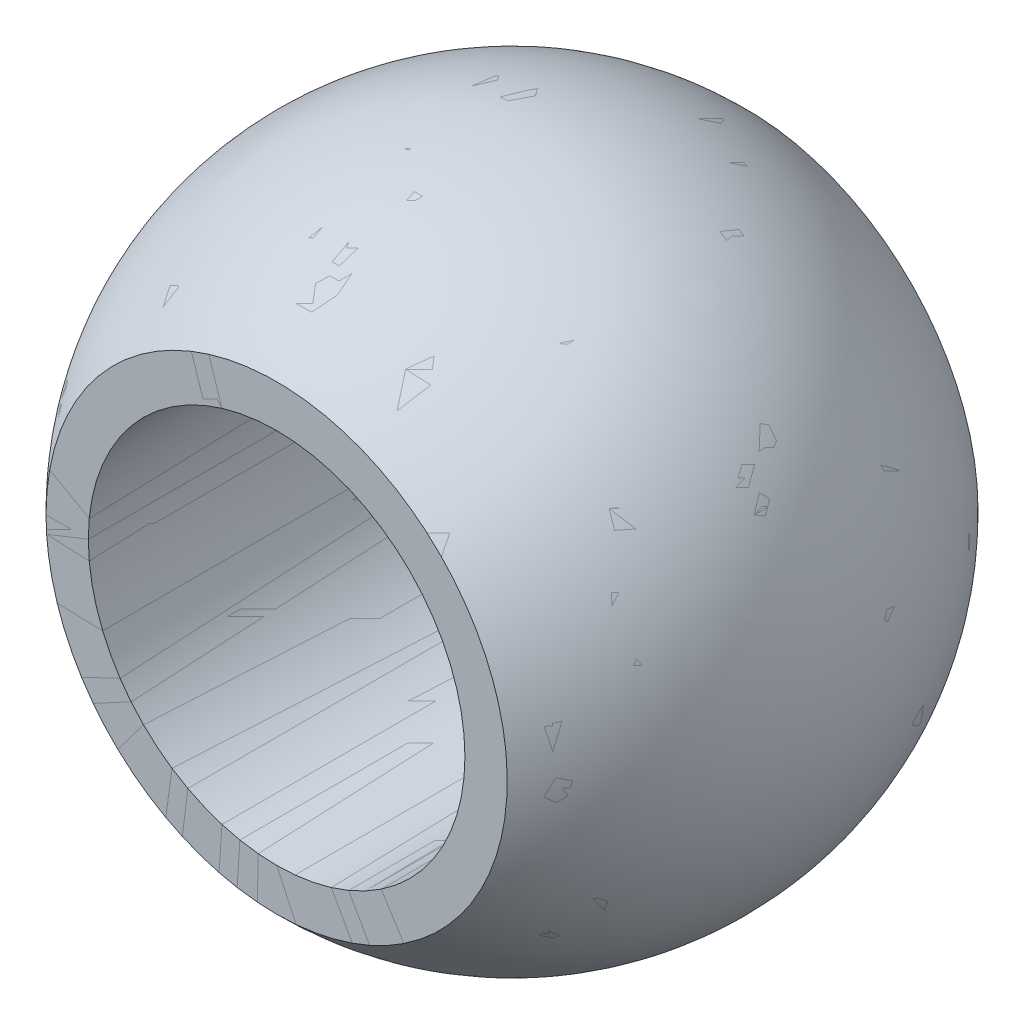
ISO-10303-21;
HEADER;
FILE_DESCRIPTION(('STEP AP214'),'2;1');
FILE_NAME('part.step','',(''),(''),'','','');
FILE_SCHEMA(('AUTOMOTIVE_DESIGN { 1 0 10303 214 1 1 1 1 }'));
ENDSEC;
DATA;
#1=APPLICATION_CONTEXT('core data for automotive mechanical design processes');
#2=APPLICATION_PROTOCOL_DEFINITION('international standard','automotive_design',2000,#1);
#3=PRODUCT_CONTEXT('',#1,'mechanical');
#4=PRODUCT('Part','Part','',(#3));
#5=PRODUCT_RELATED_PRODUCT_CATEGORY('part','',(#4));
#6=PRODUCT_DEFINITION_FORMATION('','',#4);
#7=PRODUCT_DEFINITION_CONTEXT('part definition',#1,'design');
#8=PRODUCT_DEFINITION('design','',#6,#7);
#9=PRODUCT_DEFINITION_SHAPE('','',#8);
#10=(LENGTH_UNIT() NAMED_UNIT(*) SI_UNIT(.MILLI.,.METRE.));
#11=(NAMED_UNIT(*) PLANE_ANGLE_UNIT() SI_UNIT($,.RADIAN.));
#12=(NAMED_UNIT(*) SI_UNIT($,.STERADIAN.) SOLID_ANGLE_UNIT());
#13=UNCERTAINTY_MEASURE_WITH_UNIT(LENGTH_MEASURE(1.E-05),#10,'distance_accuracy_value','');
#14=(GEOMETRIC_REPRESENTATION_CONTEXT(3) GLOBAL_UNCERTAINTY_ASSIGNED_CONTEXT((#13)) GLOBAL_UNIT_ASSIGNED_CONTEXT((#10,
#11,#12)) REPRESENTATION_CONTEXT('',''));
#15=CARTESIAN_POINT('',(0.,0.,0.));
#16=DIRECTION('',(0.,0.,1.));
#17=DIRECTION('',(1.,0.,0.));
#18=AXIS2_PLACEMENT_3D('',#15,#16,#17);
#19=CARTESIAN_POINT('',(-9.7979589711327,-9.7979589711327,-10.));
#20=DIRECTION('',(0.,0.,1.));
#21=DIRECTION('',(1.,0.,0.));
#22=AXIS2_PLACEMENT_3D('',#19,#20,#21);
#23=PLANE('',#22);
#24=CARTESIAN_POINT('',(0.,0.,-10.));
#25=DIRECTION('',(0.,0.,1.));
#26=DIRECTION('',(0.,-1.,0.));
#27=AXIS2_PLACEMENT_3D('',#24,#25,#26);
#28=CIRCLE('',#27,8.);
#29=CARTESIAN_POINT('',(0.,-8.,-10.));
#30=VERTEX_POINT('',#29);
#31=EDGE_CURVE('P0_E391',#30,#30,#28,.F.);
#32=ORIENTED_EDGE('',*,*,#31,.F.);
#33=EDGE_LOOP('',(#32));
#34=FACE_BOUND('',#33,.T.);
#35=CARTESIAN_POINT('',(9.79795897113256,-1.82145964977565E-13,-10.));
#36=CARTESIAN_POINT('',(9.7979598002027,0.250752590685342,-10.));
#37=CARTESIAN_POINT('',(9.78832968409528,0.501492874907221,-10.));
#38=CARTESIAN_POINT('',(9.74808607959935,1.02461079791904,-9.99999999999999));
#39=CARTESIAN_POINT('',(9.71561679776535,1.29684806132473,-10.));
#40=CARTESIAN_POINT('',(9.62798676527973,1.83763773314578,-10.));
#41=CARTESIAN_POINT('',(9.57282601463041,2.10619014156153,-9.99999999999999));
#42=CARTESIAN_POINT('',(9.44020112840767,2.63773216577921,-10.));
#43=CARTESIAN_POINT('',(9.36273699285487,2.90072178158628,-10.));
#44=CARTESIAN_POINT('',(9.18604983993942,3.41928668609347,-10.));
#45=CARTESIAN_POINT('',(9.08682682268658,3.67486197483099,-10.));
#46=CARTESIAN_POINT('',(8.86731947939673,4.17680221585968,-10.));
#47=CARTESIAN_POINT('',(8.7470351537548,4.42316716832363,-10.));
#48=CARTESIAN_POINT('',(8.48625079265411,4.90495458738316,-10.));
#49=CARTESIAN_POINT('',(8.34575075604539,5.14037705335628,-10.));
#50=CARTESIAN_POINT('',(8.04552271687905,5.59862448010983,-9.99999999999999));
#51=CARTESIAN_POINT('',(7.88579471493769,5.82144944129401,-9.99999999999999));
#52=CARTESIAN_POINT('',(7.54823364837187,6.25293536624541,-10.));
#53=CARTESIAN_POINT('',(7.37040058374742,6.46159633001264,-10.));
#54=CARTESIAN_POINT('',(6.99787957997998,6.86328735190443,-10.));
#55=CARTESIAN_POINT('',(6.80319164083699,7.05631741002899,-9.99999999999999));
#56=CARTESIAN_POINT('',(6.39832956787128,7.42538959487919,-9.99999999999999));
#57=CARTESIAN_POINT('',(6.18815543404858,7.60143172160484,-10.));
#58=CARTESIAN_POINT('',(5.75379852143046,7.93529044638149,-10.));
#59=CARTESIAN_POINT('',(5.52961574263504,8.0931070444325,-10.));
#60=CARTESIAN_POINT('',(5.06881757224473,8.38940524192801,-9.99999999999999));
#61=CARTESIAN_POINT('',(4.83220218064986,8.52788684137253,-10.));
#62=CARTESIAN_POINT('',(4.34820221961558,8.78454149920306,-10.));
#63=CARTESIAN_POINT('',(4.10081765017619,8.90271455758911,-9.99999999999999));
#64=CARTESIAN_POINT('',(3.59701847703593,9.11792136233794,-10.));
#65=CARTESIAN_POINT('',(3.34060387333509,9.21495510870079,-10.));
#66=CARTESIAN_POINT('',(2.82054725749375,9.38720113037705,-10.));
#67=CARTESIAN_POINT('',(2.55690524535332,9.46241340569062,-10.));
#68=CARTESIAN_POINT('',(2.02424724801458,9.59048773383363,-10.));
#69=CARTESIAN_POINT('',(1.75523126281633,9.64334978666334,-10.));
#70=CARTESIAN_POINT('',(1.21371653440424,9.72635204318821,-9.99999999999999));
#71=CARTESIAN_POINT('',(0.941217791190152,9.75649224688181,-10.));
#72=CARTESIAN_POINT('',(0.394653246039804,9.7938389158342,-10.));
#73=CARTESIAN_POINT('',(0.120587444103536,9.80104538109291,-10.));
#74=CARTESIAN_POINT('',(-0.427184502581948,9.79247391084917,-10.));
#75=CARTESIAN_POINT('',(-0.700890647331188,9.7766959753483,-9.99999999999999));
#76=CARTESIAN_POINT('',(-1.24601909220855,9.72226662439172,-10.));
#77=CARTESIAN_POINT('',(-1.51744139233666,9.68361520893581,-10.));
#78=CARTESIAN_POINT('',(-2.05609401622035,9.58371062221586,-10.));
#79=CARTESIAN_POINT('',(-2.32332433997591,9.52245745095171,-10.));
#80=CARTESIAN_POINT('',(-2.85171434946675,9.37777996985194,-9.99999999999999));
#81=CARTESIAN_POINT('',(-3.11287403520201,9.29435566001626,-9.99999999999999));
#82=CARTESIAN_POINT('',(-3.62728678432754,9.10592238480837,-10.));
#83=CARTESIAN_POINT('',(-3.88053984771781,9.00091341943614,-10.));
#84=CARTESIAN_POINT('',(-4.37735895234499,8.77004905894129,-10.));
#85=CARTESIAN_POINT('',(-4.62092499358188,8.64419366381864,-10.));
#86=CARTESIAN_POINT('',(-5.09665775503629,8.37252122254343,-10.));
#87=CARTESIAN_POINT('',(-5.32882447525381,8.22670417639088,-10.));
#88=CARTESIAN_POINT('',(-5.78012643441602,7.91613354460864,-10.));
#89=CARTESIAN_POINT('',(-5.9992616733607,7.75137995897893,-10.));
#90=CARTESIAN_POINT('',(-6.42296012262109,7.4040944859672,-10.));
#91=CARTESIAN_POINT('',(-6.6275233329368,7.22156259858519,-10.));
#92=CARTESIAN_POINT('',(-7.02063962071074,6.84000374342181,-10.));
#93=CARTESIAN_POINT('',(-7.20919269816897,6.64097677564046,-10.));
#94=CARTESIAN_POINT('',(-7.5689631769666,6.22782693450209,-10.));
#95=CARTESIAN_POINT('',(-7.74018057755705,6.01370406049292,-10.));
#96=CARTESIAN_POINT('',(-8.06407600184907,5.57186774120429,-9.99999999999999));
#97=CARTESIAN_POINT('',(-8.21675402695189,5.34415429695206,-9.99999999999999));
#98=CARTESIAN_POINT('',(-8.5024973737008,4.87673767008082,-10.));
#99=CARTESIAN_POINT('',(-8.63556269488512,4.63703448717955,-10.));
#100=CARTESIAN_POINT('',(-8.88114516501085,4.14732352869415,-10.));
#101=CARTESIAN_POINT('',(-8.99366231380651,3.89731575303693,-10.));
#102=CARTESIAN_POINT('',(-9.19735742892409,3.38875319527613,-9.99999999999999));
#103=CARTESIAN_POINT('',(-9.2885353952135,3.13019841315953,-10.));
#104=CARTESIAN_POINT('',(-9.4489111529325,2.60635951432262,-10.));
#105=CARTESIAN_POINT('',(-9.51810894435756,2.34107539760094,-10.));
#106=CARTESIAN_POINT('',(-9.63403788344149,1.80564280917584,-9.99999999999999));
#107=CARTESIAN_POINT('',(-9.68076903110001,1.53549433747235,-9.99999999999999));
#108=CARTESIAN_POINT('',(-9.75143615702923,0.992232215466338,-9.99999999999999));
#109=CARTESIAN_POINT('',(-9.77537213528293,0.719118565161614,-10.));
#110=CARTESIAN_POINT('',(-9.80028064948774,0.17184610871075,-10.));
#111=CARTESIAN_POINT('',(-9.8012531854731,-0.10231269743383,-10.));
#112=CARTESIAN_POINT('',(-9.78022797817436,-0.649748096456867,-10.));
#113=CARTESIAN_POINT('',(-9.75823023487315,-0.923024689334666,-10.));
#114=CARTESIAN_POINT('',(-9.69141911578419,-1.46677449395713,-10.));
#115=CARTESIAN_POINT('',(-9.64660573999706,-1.73724770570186,-10.));
#116=CARTESIAN_POINT('',(-9.53447839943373,-2.27348928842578,-10.));
#117=CARTESIAN_POINT('',(-9.46716443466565,-2.53925765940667,-10.));
#118=CARTESIAN_POINT('',(-9.31050914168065,-3.06422117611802,-10.));
#119=CARTESIAN_POINT('',(-9.22116781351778,-3.32341632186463,-10.));
#120=CARTESIAN_POINT('',(-9.02108587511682,-3.83341121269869,-10.));
#121=CARTESIAN_POINT('',(-8.91034526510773,-4.084210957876,-10.));
#122=CARTESIAN_POINT('',(-8.66824328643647,-4.57565188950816,-10.));
#123=CARTESIAN_POINT('',(-8.53688191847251,-4.81629307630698,-9.99999999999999));
#124=CARTESIAN_POINT('',(-8.25446189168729,-5.28572518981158,-9.99999999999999));
#125=CARTESIAN_POINT('',(-8.10340323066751,-5.51451611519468,-9.99999999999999));
#126=CARTESIAN_POINT('',(-7.78265060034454,-5.95863923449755,-10.));
#127=CARTESIAN_POINT('',(-7.61295663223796,-6.17397142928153,-10.));
#128=CARTESIAN_POINT('',(-7.2561263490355,-6.58966329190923,-10.));
#129=CARTESIAN_POINT('',(-7.06899003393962,-6.79002295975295,-10.));
#130=CARTESIAN_POINT('',(-6.67859064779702,-7.17436121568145,-9.99999999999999));
#131=CARTESIAN_POINT('',(-6.47532757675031,-7.35833980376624,-9.99999999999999));
#132=CARTESIAN_POINT('',(-6.05410364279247,-7.70862250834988,-9.99999999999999));
#133=CARTESIAN_POINT('',(-5.83614277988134,-7.87492662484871,-10.));
#134=CARTESIAN_POINT('',(-5.38705555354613,-8.18869124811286,-10.));
#135=CARTESIAN_POINT('',(-5.15592919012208,-8.33615175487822,-9.99999999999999));
#136=CARTESIAN_POINT('',(-4.68213580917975,-8.61119249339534,-10.));
#137=CARTESIAN_POINT('',(-4.43946879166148,-8.73877272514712,-10.));
#138=CARTESIAN_POINT('',(-3.94430008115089,-8.97315600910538,-10.));
#139=CARTESIAN_POINT('',(-3.69179838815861,-9.07995906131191,-10.));
#140=CARTESIAN_POINT('',(-3.17873544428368,-9.27203714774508,-10.));
#141=CARTESIAN_POINT('',(-2.91817419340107,-9.35731218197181,-10.));
#142=CARTESIAN_POINT('',(-2.3908239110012,-9.50573473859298,-10.));
#143=CARTESIAN_POINT('',(-2.12403487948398,-9.56888226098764,-10.));
#144=CARTESIAN_POINT('',(-1.58610459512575,-9.67260585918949,-10.));
#145=CARTESIAN_POINT('',(-1.31496334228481,-9.71318193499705,-9.99999999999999));
#146=CARTESIAN_POINT('',(-0.770234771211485,-9.7714773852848,-9.99999999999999));
#147=CARTESIAN_POINT('',(-0.49664745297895,-9.78919675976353,-9.99999999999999));
#148=CARTESIAN_POINT('',(0.0510498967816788,-9.80165423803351,-10.));
#149=CARTESIAN_POINT('',(0.325159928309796,-9.79639234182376,-10.));
#150=CARTESIAN_POINT('',(0.871975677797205,-9.76292427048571,-10.));
#151=CARTESIAN_POINT('',(1.14468139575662,-9.73471809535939,-10.));
#152=CARTESIAN_POINT('',(1.6867713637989,-9.65555975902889,-10.));
#153=CARTESIAN_POINT('',(1.95615561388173,-9.60460759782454,-9.99999999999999));
#154=CARTESIAN_POINT('',(2.4897088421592,-9.48031548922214,-9.99999999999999));
#155=CARTESIAN_POINT('',(2.7538778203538,-9.40697554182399,-9.99999999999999));
#156=CARTESIAN_POINT('',(3.27514336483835,-9.23842344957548,-9.99999999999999));
#157=CARTESIAN_POINT('',(3.53223993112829,-9.14321130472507,-9.99999999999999));
#158=CARTESIAN_POINT('',(4.03755323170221,-8.93158417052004,-10.));
#159=CARTESIAN_POINT('',(4.28576996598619,-8.81516918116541,-10.));
#160=CARTESIAN_POINT('',(4.77157860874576,-8.56195476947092,-10.));
#161=CARTESIAN_POINT('',(5.00917051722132,-8.42515534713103,-10.));
#162=CARTESIAN_POINT('',(5.47205920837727,-8.13213378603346,-10.));
#163=CARTESIAN_POINT('',(5.69735599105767,-7.97591164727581,-9.99999999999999));
#164=CARTESIAN_POINT('',(6.13407056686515,-7.64514291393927,-10.));
#165=CARTESIAN_POINT('',(6.34548835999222,-7.47059631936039,-10.));
#166=CARTESIAN_POINT('',(6.75295866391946,-7.10440575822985,-10.));
#167=CARTESIAN_POINT('',(6.94901117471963,-6.91276179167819,-10.));
#168=CARTESIAN_POINT('',(7.32437265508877,-6.51372375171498,-10.));
#169=CARTESIAN_POINT('',(7.50368162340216,-6.30632967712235,-10.));
#170=CARTESIAN_POINT('',(7.84429541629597,-5.87724946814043,-10.));
#171=CARTESIAN_POINT('',(8.00560024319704,-5.65556333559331,-10.));
#172=CARTESIAN_POINT('',(8.30907179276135,-5.19945745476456,-10.));
#173=CARTESIAN_POINT('',(8.45123851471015,-4.96503770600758,-10.));
#174=CARTESIAN_POINT('',(8.71543440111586,-4.48511261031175,-10.));
#175=CARTESIAN_POINT('',(8.83746356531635,-4.23960726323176,-10.));
#176=CARTESIAN_POINT('',(9.06052644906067,-3.73923685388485,-10.));
#177=CARTESIAN_POINT('',(9.16156016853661,-3.48437179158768,-10.));
#178=CARTESIAN_POINT('',(9.34192190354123,-2.96707387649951,-10.));
#179=CARTESIAN_POINT('',(9.42124991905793,-2.70464102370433,-9.99999999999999));
#180=CARTESIAN_POINT('',(9.55764248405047,-2.17405174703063,-9.99999999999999));
#181=CARTESIAN_POINT('',(9.6147070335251,-1.9058953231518,-10.));
#182=CARTESIAN_POINT('',(9.70617178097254,-1.3657467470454,-10.));
#183=CARTESIAN_POINT('',(9.74057197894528,-1.09375459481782,-10.));
#184=CARTESIAN_POINT('',(9.78646512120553,-0.547836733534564,-10.));
#185=CARTESIAN_POINT('',(9.79795806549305,-0.273911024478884,-10.));
#186=CARTESIAN_POINT('',(9.79795897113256,-1.82145964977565E-13,-10.));
#187=B_SPLINE_CURVE_WITH_KNOTS('',3,(#35,#36,#37,#38,#39,#40,#41,#42,#43,#44,#45,#46,#47,#48,
#49,#50,#51,#52,#53,#54,#55,#56,#57,#58,#59,#60,#61,#62,#63,#64,#65,#66,#67,#68,#69,#70,#71,#72,
#73,#74,#75,#76,#77,#78,#79,#80,#81,#82,#83,#84,#85,#86,#87,#88,#89,#90,#91,#92,#93,#94,#95,#96,
#97,#98,#99,#100,#101,#102,#103,#104,#105,#106,#107,#108,#109,#110,#111,#112,#113,#114,#115,
#116,#117,#118,#119,#120,#121,#122,#123,#124,#125,#126,#127,#128,#129,#130,#131,#132,#133,#134,
#135,#136,#137,#138,#139,#140,#141,#142,#143,#144,#145,#146,#147,#148,#149,#150,#151,#152,#153,
#154,#155,#156,#157,#158,#159,#160,#161,#162,#163,#164,#165,#166,#167,#168,#169,#170,#171,#172,
#173,#174,#175,#176,#177,#178,#179,#180,#181,#182,#183,#184,#185,#186),.UNSPECIFIED.,.T.,.F.,(4,
2,2,2,2,2,2,2,2,2,2,2,2,2,2,2,2,2,2,2,2,2,2,2,2,2,2,2,2,2,2,2,2,2,2,2,2,2,2,2,2,2,2,2,2,2,2,2,2,
2,2,2,2,2,2,2,2,2,2,2,2,2,2,2,2,2,2,2,2,2,2,2,2,2,2,4),(0.,0.752060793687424,1.57357869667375,
2.39509659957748,3.21661450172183,4.03813239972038,4.85965028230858,5.68116821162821,
6.50268611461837,7.32420401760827,8.14572192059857,8.96723982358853,9.7887577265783,
10.6102756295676,11.4317935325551,12.2533114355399,13.074829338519,13.8963472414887,
14.7178651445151,15.5393830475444,16.3609009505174,17.1824188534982,18.0039367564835,
18.8254546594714,19.6469725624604,20.4684904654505,21.29000836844,22.1115262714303,
22.9330441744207,23.7545620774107,24.5760800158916,25.3975978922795,26.2191157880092,
27.0406336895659,27.8621515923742,28.6836694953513,29.5051873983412,30.3267053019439,
31.1482232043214,31.969741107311,32.7912590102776,33.6127769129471,34.4342948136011,
35.2558127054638,36.0773305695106,36.8988485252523,37.7203664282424,38.5418843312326,
39.3634022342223,40.1849201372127,41.006438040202,41.8279559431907,42.649473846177,
43.4709917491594,44.2925096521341,45.1140275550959,45.9355454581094,46.7570633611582,
47.5785812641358,48.4000991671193,49.2216170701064,50.0431349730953,50.8646528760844,
51.6861707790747,52.5076886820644,53.3292065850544,54.1507244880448,54.9722424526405,
55.7937603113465,56.6152782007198,57.4367961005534,58.2583140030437,59.0798319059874,
59.9013498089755,60.722867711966,61.5443856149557),.UNSPECIFIED.);
#188=CARTESIAN_POINT('',(9.79795897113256,-1.82145964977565E-13,-10.));
#189=VERTEX_POINT('',#188);
#190=EDGE_CURVE('P0_E353',#189,#189,#187,.T.);
#191=ORIENTED_EDGE('',*,*,#190,.F.);
#192=EDGE_LOOP('',(#191));
#193=FACE_BOUND('',#192,.T.);
#194=ADVANCED_FACE('P0_F348',(#34,#193),#23,.F.);
#195=CARTESIAN_POINT('',(0.,0.,-10.));
#196=DIRECTION('',(0.,0.,1.));
#197=DIRECTION('',(0.,-1.,0.));
#198=AXIS2_PLACEMENT_3D('',#195,#196,#197);
#199=CYLINDRICAL_SURFACE('',#198,8.);
#200=ORIENTED_EDGE('',*,*,#31,.T.);
#201=EDGE_LOOP('',(#200));
#202=FACE_BOUND('',#201,.T.);
#203=CARTESIAN_POINT('',(0.,0.,10.));
#204=DIRECTION('',(0.,0.,1.));
#205=DIRECTION('',(0.,-1.,0.));
#206=AXIS2_PLACEMENT_3D('',#203,#204,#205);
#207=CIRCLE('',#206,8.);
#208=CARTESIAN_POINT('',(0.,-8.,10.));
#209=VERTEX_POINT('',#208);
#210=EDGE_CURVE('P0_E361',#209,#209,#207,.T.);
#211=ORIENTED_EDGE('',*,*,#210,.T.);
#212=EDGE_LOOP('',(#211));
#213=FACE_BOUND('',#212,.T.);
#214=ADVANCED_FACE('P0_F373',(#202,#213),#199,.F.);
#215=CARTESIAN_POINT('',(9.7979589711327,-9.7979589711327,10.));
#216=DIRECTION('',(0.,0.,-1.));
#217=DIRECTION('',(-1.,0.,0.));
#218=AXIS2_PLACEMENT_3D('',#215,#216,#217);
#219=PLANE('',#218);
#220=ORIENTED_EDGE('',*,*,#210,.F.);
#221=EDGE_LOOP('',(#220));
#222=FACE_BOUND('',#221,.T.);
#223=CARTESIAN_POINT('',(-9.79795897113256,-2.92300905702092E-13,10.));
#224=CARTESIAN_POINT('',(-9.79795980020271,0.250752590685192,10.));
#225=CARTESIAN_POINT('',(-9.78832968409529,0.501492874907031,10.));
#226=CARTESIAN_POINT('',(-9.74808607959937,1.02461079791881,10.));
#227=CARTESIAN_POINT('',(-9.71561679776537,1.2968480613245,10.));
#228=CARTESIAN_POINT('',(-9.62798676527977,1.83763773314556,10.));
#229=CARTESIAN_POINT('',(-9.57282601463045,2.10619014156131,10.));
#230=CARTESIAN_POINT('',(-9.44020112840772,2.637732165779,10.));
#231=CARTESIAN_POINT('',(-9.36273699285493,2.90072178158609,9.99999999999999));
#232=CARTESIAN_POINT('',(-9.1860498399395,3.41928668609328,10.));
#233=CARTESIAN_POINT('',(-9.08682682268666,3.67486197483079,10.));
#234=CARTESIAN_POINT('',(-8.86731947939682,4.1768022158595,10.));
#235=CARTESIAN_POINT('',(-8.74703515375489,4.42316716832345,10.));
#236=CARTESIAN_POINT('',(-8.48625079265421,4.90495458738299,9.99999999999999));
#237=CARTESIAN_POINT('',(-8.34575075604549,5.14037705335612,9.99999999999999));
#238=CARTESIAN_POINT('',(-8.04552271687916,5.59862448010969,10.));
#239=CARTESIAN_POINT('',(-7.8857947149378,5.82144944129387,10.));
#240=CARTESIAN_POINT('',(-7.54823364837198,6.25293536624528,10.));
#241=CARTESIAN_POINT('',(-7.37040058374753,6.46159633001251,10.));
#242=CARTESIAN_POINT('',(-6.9978795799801,6.86328735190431,10.));
#243=CARTESIAN_POINT('',(-6.8031916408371,7.05631741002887,10.));
#244=CARTESIAN_POINT('',(-6.3983295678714,7.42538959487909,10.));
#245=CARTESIAN_POINT('',(-6.18815543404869,7.60143172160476,10.));
#246=CARTESIAN_POINT('',(-5.75379852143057,7.93529044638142,10.));
#247=CARTESIAN_POINT('',(-5.52961574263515,8.09310704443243,10.));
#248=CARTESIAN_POINT('',(-5.06881757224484,8.38940524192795,10.));
#249=CARTESIAN_POINT('',(-4.83220218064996,8.52788684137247,10.));
#250=CARTESIAN_POINT('',(-4.34820221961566,8.78454149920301,10.));
#251=CARTESIAN_POINT('',(-4.10081765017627,8.90271455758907,10.));
#252=CARTESIAN_POINT('',(-3.597018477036,9.11792136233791,10.));
#253=CARTESIAN_POINT('',(-3.34060387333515,9.21495510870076,10.));
#254=CARTESIAN_POINT('',(-2.82054725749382,9.38720113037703,10.));
#255=CARTESIAN_POINT('',(-2.55690524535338,9.4624134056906,10.));
#256=CARTESIAN_POINT('',(-2.02424724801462,9.59048773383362,10.));
#257=CARTESIAN_POINT('',(-1.75523126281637,9.64334978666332,10.));
#258=CARTESIAN_POINT('',(-1.21371653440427,9.72635204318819,10.));
#259=CARTESIAN_POINT('',(-0.941217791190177,9.7564922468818,10.));
#260=CARTESIAN_POINT('',(-0.394653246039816,9.79383891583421,10.));
#261=CARTESIAN_POINT('',(-0.12058744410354,9.80104538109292,10.));
#262=CARTESIAN_POINT('',(0.427184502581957,9.79247391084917,9.99999999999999));
#263=CARTESIAN_POINT('',(0.700890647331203,9.7766959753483,9.99999999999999));
#264=CARTESIAN_POINT('',(1.24601909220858,9.72226662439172,9.99999999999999));
#265=CARTESIAN_POINT('',(1.51744139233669,9.6836152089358,10.));
#266=CARTESIAN_POINT('',(2.05609401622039,9.58371062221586,10.));
#267=CARTESIAN_POINT('',(2.32332433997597,9.52245745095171,10.));
#268=CARTESIAN_POINT('',(2.85171434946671,9.37777996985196,10.));
#269=CARTESIAN_POINT('',(3.11287403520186,9.2943556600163,10.));
#270=CARTESIAN_POINT('',(3.62728678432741,9.10592238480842,10.));
#271=CARTESIAN_POINT('',(3.88053984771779,9.00091341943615,10.));
#272=CARTESIAN_POINT('',(4.37735895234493,8.77004905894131,10.));
#273=CARTESIAN_POINT('',(4.62092499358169,8.64419366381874,10.));
#274=CARTESIAN_POINT('',(5.09665775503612,8.37252122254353,10.));
#275=CARTESIAN_POINT('',(5.32882447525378,8.2267041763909,10.));
#276=CARTESIAN_POINT('',(5.78012643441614,7.91613354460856,9.99999999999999));
#277=CARTESIAN_POINT('',(5.99926167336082,7.75137995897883,9.99999999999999));
#278=CARTESIAN_POINT('',(6.42296012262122,7.40409448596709,9.99999999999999));
#279=CARTESIAN_POINT('',(6.62752333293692,7.22156259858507,10.));
#280=CARTESIAN_POINT('',(7.02063962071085,6.84000374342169,10.));
#281=CARTESIAN_POINT('',(7.20919269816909,6.64097677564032,10.));
#282=CARTESIAN_POINT('',(7.56896317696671,6.22782693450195,10.));
#283=CARTESIAN_POINT('',(7.74018057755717,6.01370406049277,10.));
#284=CARTESIAN_POINT('',(8.06407600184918,5.57186774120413,10.));
#285=CARTESIAN_POINT('',(8.21675402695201,5.34415429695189,10.));
#286=CARTESIAN_POINT('',(8.5024973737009,4.87673767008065,9.99999999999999));
#287=CARTESIAN_POINT('',(8.63556269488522,4.63703448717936,9.99999999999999));
#288=CARTESIAN_POINT('',(8.88114516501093,4.14732352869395,10.));
#289=CARTESIAN_POINT('',(8.99366231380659,3.89731575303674,10.));
#290=CARTESIAN_POINT('',(9.19735742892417,3.38875319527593,10.));
#291=CARTESIAN_POINT('',(9.28853539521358,3.13019841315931,10.));
#292=CARTESIAN_POINT('',(9.44891115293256,2.6063595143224,10.));
#293=CARTESIAN_POINT('',(9.51810894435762,2.34107539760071,10.));
#294=CARTESIAN_POINT('',(9.63403788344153,1.80564280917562,10.));
#295=CARTESIAN_POINT('',(9.68076903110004,1.53549433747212,10.));
#296=CARTESIAN_POINT('',(9.75143615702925,0.992232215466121,10.));
#297=CARTESIAN_POINT('',(9.77537213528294,0.719118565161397,9.99999999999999));
#298=CARTESIAN_POINT('',(9.80028064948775,0.171846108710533,10.));
#299=CARTESIAN_POINT('',(9.8012531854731,-0.102312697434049,10.));
#300=CARTESIAN_POINT('',(9.78022797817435,-0.649748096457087,10.));
#301=CARTESIAN_POINT('',(9.75823023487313,-0.923024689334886,10.));
#302=CARTESIAN_POINT('',(9.69141911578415,-1.46677449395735,10.));
#303=CARTESIAN_POINT('',(9.64660573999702,-1.73724770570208,10.));
#304=CARTESIAN_POINT('',(9.53447839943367,-2.273489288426,10.));
#305=CARTESIAN_POINT('',(9.46716443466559,-2.53925765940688,10.));
#306=CARTESIAN_POINT('',(9.31050914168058,-3.06422117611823,9.99999999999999));
#307=CARTESIAN_POINT('',(9.2211678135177,-3.32341632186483,10.));
#308=CARTESIAN_POINT('',(9.02108587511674,-3.83341121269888,10.));
#309=CARTESIAN_POINT('',(8.91034526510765,-4.08421095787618,10.));
#310=CARTESIAN_POINT('',(8.66824328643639,-4.57565188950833,10.));
#311=CARTESIAN_POINT('',(8.53688191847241,-4.81629307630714,10.));
#312=CARTESIAN_POINT('',(8.25446189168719,-5.28572518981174,10.));
#313=CARTESIAN_POINT('',(8.1034032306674,-5.51451611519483,10.));
#314=CARTESIAN_POINT('',(7.78265060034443,-5.95863923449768,10.));
#315=CARTESIAN_POINT('',(7.61295663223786,-6.17397142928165,10.));
#316=CARTESIAN_POINT('',(7.2561263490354,-6.58966329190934,10.));
#317=CARTESIAN_POINT('',(7.06899003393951,-6.79002295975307,10.));
#318=CARTESIAN_POINT('',(6.6785906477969,-7.17436121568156,10.));
#319=CARTESIAN_POINT('',(6.47532757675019,-7.35833980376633,10.));
#320=CARTESIAN_POINT('',(6.05410364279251,-7.70862250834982,10.));
#321=CARTESIAN_POINT('',(5.83614277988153,-7.87492662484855,10.));
#322=CARTESIAN_POINT('',(5.38705555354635,-8.18869124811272,10.));
#323=CARTESIAN_POINT('',(5.15592919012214,-8.33615175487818,9.99999999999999));
#324=CARTESIAN_POINT('',(4.68213580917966,-8.61119249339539,9.99999999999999));
#325=CARTESIAN_POINT('',(4.43946879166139,-8.73877272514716,10.));
#326=CARTESIAN_POINT('',(3.94430008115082,-8.97315600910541,10.));
#327=CARTESIAN_POINT('',(3.69179838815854,-9.07995906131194,10.));
#328=CARTESIAN_POINT('',(3.17873544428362,-9.2720371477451,10.));
#329=CARTESIAN_POINT('',(2.91817419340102,-9.35731218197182,10.));
#330=CARTESIAN_POINT('',(2.39082391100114,-9.50573473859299,10.));
#331=CARTESIAN_POINT('',(2.12403487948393,-9.56888226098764,10.));
#332=CARTESIAN_POINT('',(1.58610459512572,-9.6726058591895,10.));
#333=CARTESIAN_POINT('',(1.31496334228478,-9.71318193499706,9.99999999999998));
#334=CARTESIAN_POINT('',(0.770234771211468,-9.7714773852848,9.99999999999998));
#335=CARTESIAN_POINT('',(0.49664745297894,-9.78919675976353,10.));
#336=CARTESIAN_POINT('',(-0.0510498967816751,-9.80165423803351,10.));
#337=CARTESIAN_POINT('',(-0.325159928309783,-9.79639234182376,10.));
#338=CARTESIAN_POINT('',(-0.871975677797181,-9.76292427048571,9.99999999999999));
#339=CARTESIAN_POINT('',(-1.14468139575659,-9.73471809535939,9.99999999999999));
#340=CARTESIAN_POINT('',(-1.68677136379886,-9.65555975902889,9.99999999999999));
#341=CARTESIAN_POINT('',(-1.95615561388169,-9.60460759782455,9.99999999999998));
#342=CARTESIAN_POINT('',(-2.48970884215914,-9.48031548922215,9.99999999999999));
#343=CARTESIAN_POINT('',(-2.75387782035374,-9.40697554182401,9.99999999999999));
#344=CARTESIAN_POINT('',(-3.27514336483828,-9.2384234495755,10.));
#345=CARTESIAN_POINT('',(-3.53223993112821,-9.1432113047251,10.));
#346=CARTESIAN_POINT('',(-4.03755323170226,-8.93158417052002,10.));
#347=CARTESIAN_POINT('',(-4.28576996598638,-8.81516918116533,10.));
#348=CARTESIAN_POINT('',(-4.77157860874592,-8.56195476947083,10.));
#349=CARTESIAN_POINT('',(-5.00917051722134,-8.42515534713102,9.99999999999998));
#350=CARTESIAN_POINT('',(-5.47205920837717,-8.13213378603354,9.99999999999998));
#351=CARTESIAN_POINT('',(-5.69735599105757,-7.97591164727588,10.));
#352=CARTESIAN_POINT('',(-6.13407056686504,-7.64514291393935,10.));
#353=CARTESIAN_POINT('',(-6.3454883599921,-7.47059631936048,10.));
#354=CARTESIAN_POINT('',(-6.75295866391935,-7.10440575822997,10.));
#355=CARTESIAN_POINT('',(-6.94901117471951,-6.91276179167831,10.));
#356=CARTESIAN_POINT('',(-7.32437265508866,-6.51372375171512,9.99999999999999));
#357=CARTESIAN_POINT('',(-7.50368162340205,-6.30632967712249,9.99999999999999));
#358=CARTESIAN_POINT('',(-7.84429541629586,-5.87724946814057,9.99999999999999));
#359=CARTESIAN_POINT('',(-8.00560024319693,-5.65556333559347,10.));
#360=CARTESIAN_POINT('',(-8.30907179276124,-5.19945745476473,10.));
#361=CARTESIAN_POINT('',(-8.45123851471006,-4.96503770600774,10.));
#362=CARTESIAN_POINT('',(-8.71543440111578,-4.48511261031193,9.99999999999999));
#363=CARTESIAN_POINT('',(-8.83746356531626,-4.23960726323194,9.99999999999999));
#364=CARTESIAN_POINT('',(-9.06052644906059,-3.73923685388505,10.));
#365=CARTESIAN_POINT('',(-9.16156016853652,-3.48437179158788,10.));
#366=CARTESIAN_POINT('',(-9.34192190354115,-2.96707387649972,10.));
#367=CARTESIAN_POINT('',(-9.42124991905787,-2.70464102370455,9.99999999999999));
#368=CARTESIAN_POINT('',(-9.55764248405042,-2.17405174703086,9.99999999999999));
#369=CARTESIAN_POINT('',(-9.61470703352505,-1.90589532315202,10.));
#370=CARTESIAN_POINT('',(-9.70617178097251,-1.36574674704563,10.));
#371=CARTESIAN_POINT('',(-9.74057197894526,-1.09375459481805,10.));
#372=CARTESIAN_POINT('',(-9.78646512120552,-0.547836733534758,9.99999999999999));
#373=CARTESIAN_POINT('',(-9.79795806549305,-0.273911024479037,10.));
#374=CARTESIAN_POINT('',(-9.79795897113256,-2.92300905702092E-13,10.));
#375=B_SPLINE_CURVE_WITH_KNOTS('',3,(#223,#224,#225,#226,#227,#228,#229,#230,#231,#232,#233,
#234,#235,#236,#237,#238,#239,#240,#241,#242,#243,#244,#245,#246,#247,#248,#249,#250,#251,#252,
#253,#254,#255,#256,#257,#258,#259,#260,#261,#262,#263,#264,#265,#266,#267,#268,#269,#270,#271,
#272,#273,#274,#275,#276,#277,#278,#279,#280,#281,#282,#283,#284,#285,#286,#287,#288,#289,#290,
#291,#292,#293,#294,#295,#296,#297,#298,#299,#300,#301,#302,#303,#304,#305,#306,#307,#308,#309,
#310,#311,#312,#313,#314,#315,#316,#317,#318,#319,#320,#321,#322,#323,#324,#325,#326,#327,#328,
#329,#330,#331,#332,#333,#334,#335,#336,#337,#338,#339,#340,#341,#342,#343,#344,#345,#346,#347,
#348,#349,#350,#351,#352,#353,#354,#355,#356,#357,#358,#359,#360,#361,#362,#363,#364,#365,#366,
#367,#368,#369,#370,#371,#372,#373,#374),.UNSPECIFIED.,.T.,.F.,(4,2,2,2,2,2,2,2,2,2,2,2,2,2,2,2,
2,2,2,2,2,2,2,2,2,2,2,2,2,2,2,2,2,2,2,2,2,2,2,2,2,2,2,2,2,2,2,2,2,2,2,2,2,2,2,2,2,2,2,2,2,2,2,2,
2,2,2,2,2,2,2,2,2,2,2,4),(0.,0.752060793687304,1.57357869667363,2.39509659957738,
3.21661450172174,4.03813239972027,4.85965028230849,5.68116821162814,6.50268611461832,
7.3242040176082,8.14572192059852,8.96723982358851,9.78875772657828,10.6102756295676,
11.4317935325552,12.2533114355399,13.0748293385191,13.8963472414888,14.7178651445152,
15.5393830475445,16.3609009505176,17.1824188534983,18.0039367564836,18.8254546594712,
19.6469725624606,20.4684904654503,21.2900083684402,22.1115262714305,22.933044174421,
23.754562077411,24.5760800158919,25.3975978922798,26.2191157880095,27.0406336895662,
27.8621515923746,28.6836694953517,29.5051873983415,30.3267053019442,31.1482232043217,
31.9697411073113,32.7912590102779,33.6127769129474,34.4342948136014,35.2558127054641,
36.0773305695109,36.8988485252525,37.7203664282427,38.5418843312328,39.3634022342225,
40.1849201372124,41.0064380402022,41.8279559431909,42.6494738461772,43.4709917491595,
44.2925096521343,45.114027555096,45.9355454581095,46.7570633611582,47.5785812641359,
48.4000991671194,49.2216170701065,50.0431349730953,50.8646528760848,51.6861707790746,
52.5076886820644,53.3292065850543,54.1507244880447,54.9722424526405,55.7937603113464,
56.6152782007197,57.4367961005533,58.2583140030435,59.0798319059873,59.9013498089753,
60.7228677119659,61.5443856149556),.UNSPECIFIED.);
#376=CARTESIAN_POINT('',(-9.79795897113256,-2.92300905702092E-13,10.));
#377=VERTEX_POINT('',#376);
#378=EDGE_CURVE('P0_E11',#377,#377,#375,.T.);
#379=ORIENTED_EDGE('',*,*,#378,.F.);
#380=EDGE_LOOP('',(#379));
#381=FACE_BOUND('',#380,.T.);
#382=ADVANCED_FACE('P0_F350',(#222,#381),#219,.F.);
#383=CARTESIAN_POINT('',(-14.,0.,0.));
#384=CARTESIAN_POINT('',(-14.,11.326237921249,8.2289935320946));
#385=CARTESIAN_POINT('',(0.,11.326237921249,8.2289935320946));
#386=CARTESIAN_POINT('',(14.,11.326237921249,8.2289935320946));
#387=CARTESIAN_POINT('',(14.,0.,0.));
#388=(BOUNDED_CURVE() B_SPLINE_CURVE(2,(#383,#384,#385,#386,#387),.UNSPECIFIED.,.F.,
.F.) B_SPLINE_CURVE_WITH_KNOTS((3,2,3),(0.,0.5,1.),
.UNSPECIFIED.) CURVE() GEOMETRIC_REPRESENTATION_ITEM() RATIONAL_B_SPLINE_CURVE((1.,
0.70710678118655,1.,0.70710678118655,1.)) REPRESENTATION_ITEM(''));
#389=CARTESIAN_POINT('',(0.,0.,0.));
#390=DIRECTION('',(-1.,0.,0.));
#391=AXIS1_PLACEMENT('',#389,#390);
#392=SURFACE_OF_REVOLUTION('',#388,#391);
#393=CARTESIAN_POINT('',(13.9999999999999,0.,0.));
#394=VERTEX_POINT('',#393);
#395=VERTEX_LOOP('',#394);
#396=FACE_BOUND('',#395,.T.);
#397=ORIENTED_EDGE('',*,*,#378,.T.);
#398=EDGE_LOOP('',(#397));
#399=FACE_BOUND('',#398,.T.);
#400=ORIENTED_EDGE('',*,*,#190,.T.);
#401=EDGE_LOOP('',(#400));
#402=FACE_BOUND('',#401,.T.);
#403=CARTESIAN_POINT('',(-13.9999999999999,0.,0.));
#404=VERTEX_POINT('',#403);
#405=VERTEX_LOOP('',#404);
#406=FACE_BOUND('',#405,.T.);
#407=ADVANCED_FACE('P0_F368',(#396,#399,#402,#406),#392,.F.);
#408=CLOSED_SHELL('',(#194,#214,#382,#407));
#409=MANIFOLD_SOLID_BREP('P0_B2',#408);
#410=CARTESIAN_POINT('',(-9.7979589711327,-9.7979589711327,-10.));
#411=DIRECTION('',(0.,0.,1.));
#412=DIRECTION('',(1.,0.,0.));
#413=AXIS2_PLACEMENT_3D('',#410,#411,#412);
#414=PLANE('',#413);
#415=CARTESIAN_POINT('',(0.,0.,-10.));
#416=DIRECTION('',(0.,0.,1.));
#417=DIRECTION('',(0.,-1.,0.));
#418=AXIS2_PLACEMENT_3D('',#415,#416,#417);
#419=CIRCLE('',#418,8.);
#420=CARTESIAN_POINT('',(0.,-8.,-10.));
#421=VERTEX_POINT('',#420);
#422=EDGE_CURVE('P1_E58',#421,#421,#419,.F.);
#423=ORIENTED_EDGE('',*,*,#422,.F.);
#424=EDGE_LOOP('',(#423));
#425=FACE_BOUND('',#424,.T.);
#426=CARTESIAN_POINT('',(9.79795897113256,-1.82145964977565E-13,-10.));
#427=CARTESIAN_POINT('',(9.7979598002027,0.250752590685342,-10.));
#428=CARTESIAN_POINT('',(9.78832968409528,0.501492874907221,-10.));
#429=CARTESIAN_POINT('',(9.74808607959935,1.02461079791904,-9.99999999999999));
#430=CARTESIAN_POINT('',(9.71561679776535,1.29684806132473,-10.));
#431=CARTESIAN_POINT('',(9.62798676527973,1.83763773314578,-10.));
#432=CARTESIAN_POINT('',(9.57282601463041,2.10619014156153,-9.99999999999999));
#433=CARTESIAN_POINT('',(9.44020112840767,2.63773216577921,-10.));
#434=CARTESIAN_POINT('',(9.36273699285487,2.90072178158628,-10.));
#435=CARTESIAN_POINT('',(9.18604983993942,3.41928668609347,-10.));
#436=CARTESIAN_POINT('',(9.08682682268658,3.67486197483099,-10.));
#437=CARTESIAN_POINT('',(8.86731947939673,4.17680221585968,-10.));
#438=CARTESIAN_POINT('',(8.7470351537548,4.42316716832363,-10.));
#439=CARTESIAN_POINT('',(8.48625079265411,4.90495458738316,-10.));
#440=CARTESIAN_POINT('',(8.34575075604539,5.14037705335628,-10.));
#441=CARTESIAN_POINT('',(8.04552271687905,5.59862448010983,-9.99999999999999));
#442=CARTESIAN_POINT('',(7.88579471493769,5.82144944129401,-9.99999999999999));
#443=CARTESIAN_POINT('',(7.54823364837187,6.25293536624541,-10.));
#444=CARTESIAN_POINT('',(7.37040058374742,6.46159633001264,-10.));
#445=CARTESIAN_POINT('',(6.99787957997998,6.86328735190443,-10.));
#446=CARTESIAN_POINT('',(6.80319164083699,7.05631741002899,-9.99999999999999));
#447=CARTESIAN_POINT('',(6.39832956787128,7.42538959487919,-9.99999999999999));
#448=CARTESIAN_POINT('',(6.18815543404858,7.60143172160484,-10.));
#449=CARTESIAN_POINT('',(5.75379852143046,7.93529044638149,-10.));
#450=CARTESIAN_POINT('',(5.52961574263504,8.0931070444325,-10.));
#451=CARTESIAN_POINT('',(5.06881757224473,8.38940524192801,-9.99999999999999));
#452=CARTESIAN_POINT('',(4.83220218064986,8.52788684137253,-10.));
#453=CARTESIAN_POINT('',(4.34820221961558,8.78454149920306,-10.));
#454=CARTESIAN_POINT('',(4.10081765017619,8.90271455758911,-9.99999999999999));
#455=CARTESIAN_POINT('',(3.59701847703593,9.11792136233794,-10.));
#456=CARTESIAN_POINT('',(3.34060387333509,9.21495510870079,-10.));
#457=CARTESIAN_POINT('',(2.82054725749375,9.38720113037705,-10.));
#458=CARTESIAN_POINT('',(2.55690524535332,9.46241340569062,-10.));
#459=CARTESIAN_POINT('',(2.02424724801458,9.59048773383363,-10.));
#460=CARTESIAN_POINT('',(1.75523126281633,9.64334978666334,-10.));
#461=CARTESIAN_POINT('',(1.21371653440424,9.72635204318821,-9.99999999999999));
#462=CARTESIAN_POINT('',(0.941217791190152,9.75649224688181,-10.));
#463=CARTESIAN_POINT('',(0.394653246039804,9.7938389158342,-10.));
#464=CARTESIAN_POINT('',(0.120587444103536,9.80104538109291,-10.));
#465=CARTESIAN_POINT('',(-0.427184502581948,9.79247391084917,-10.));
#466=CARTESIAN_POINT('',(-0.700890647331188,9.7766959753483,-9.99999999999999));
#467=CARTESIAN_POINT('',(-1.24601909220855,9.72226662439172,-10.));
#468=CARTESIAN_POINT('',(-1.51744139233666,9.68361520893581,-10.));
#469=CARTESIAN_POINT('',(-2.05609401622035,9.58371062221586,-10.));
#470=CARTESIAN_POINT('',(-2.32332433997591,9.52245745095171,-10.));
#471=CARTESIAN_POINT('',(-2.85171434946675,9.37777996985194,-9.99999999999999));
#472=CARTESIAN_POINT('',(-3.11287403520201,9.29435566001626,-9.99999999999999));
#473=CARTESIAN_POINT('',(-3.62728678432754,9.10592238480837,-10.));
#474=CARTESIAN_POINT('',(-3.88053984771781,9.00091341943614,-10.));
#475=CARTESIAN_POINT('',(-4.37735895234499,8.77004905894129,-10.));
#476=CARTESIAN_POINT('',(-4.62092499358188,8.64419366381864,-10.));
#477=CARTESIAN_POINT('',(-5.09665775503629,8.37252122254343,-10.));
#478=CARTESIAN_POINT('',(-5.32882447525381,8.22670417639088,-10.));
#479=CARTESIAN_POINT('',(-5.78012643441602,7.91613354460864,-10.));
#480=CARTESIAN_POINT('',(-5.9992616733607,7.75137995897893,-10.));
#481=CARTESIAN_POINT('',(-6.42296012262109,7.4040944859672,-10.));
#482=CARTESIAN_POINT('',(-6.6275233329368,7.22156259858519,-10.));
#483=CARTESIAN_POINT('',(-7.02063962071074,6.84000374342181,-10.));
#484=CARTESIAN_POINT('',(-7.20919269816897,6.64097677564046,-10.));
#485=CARTESIAN_POINT('',(-7.5689631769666,6.22782693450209,-10.));
#486=CARTESIAN_POINT('',(-7.74018057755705,6.01370406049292,-10.));
#487=CARTESIAN_POINT('',(-8.06407600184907,5.57186774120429,-9.99999999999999));
#488=CARTESIAN_POINT('',(-8.21675402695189,5.34415429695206,-9.99999999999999));
#489=CARTESIAN_POINT('',(-8.5024973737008,4.87673767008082,-10.));
#490=CARTESIAN_POINT('',(-8.63556269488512,4.63703448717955,-10.));
#491=CARTESIAN_POINT('',(-8.88114516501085,4.14732352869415,-10.));
#492=CARTESIAN_POINT('',(-8.99366231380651,3.89731575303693,-10.));
#493=CARTESIAN_POINT('',(-9.19735742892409,3.38875319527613,-9.99999999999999));
#494=CARTESIAN_POINT('',(-9.2885353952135,3.13019841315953,-10.));
#495=CARTESIAN_POINT('',(-9.4489111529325,2.60635951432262,-10.));
#496=CARTESIAN_POINT('',(-9.51810894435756,2.34107539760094,-10.));
#497=CARTESIAN_POINT('',(-9.63403788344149,1.80564280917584,-9.99999999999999));
#498=CARTESIAN_POINT('',(-9.68076903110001,1.53549433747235,-9.99999999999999));
#499=CARTESIAN_POINT('',(-9.75143615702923,0.992232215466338,-9.99999999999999));
#500=CARTESIAN_POINT('',(-9.77537213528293,0.719118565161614,-10.));
#501=CARTESIAN_POINT('',(-9.80028064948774,0.17184610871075,-10.));
#502=CARTESIAN_POINT('',(-9.8012531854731,-0.10231269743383,-10.));
#503=CARTESIAN_POINT('',(-9.78022797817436,-0.649748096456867,-10.));
#504=CARTESIAN_POINT('',(-9.75823023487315,-0.923024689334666,-10.));
#505=CARTESIAN_POINT('',(-9.69141911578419,-1.46677449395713,-10.));
#506=CARTESIAN_POINT('',(-9.64660573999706,-1.73724770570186,-10.));
#507=CARTESIAN_POINT('',(-9.53447839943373,-2.27348928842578,-10.));
#508=CARTESIAN_POINT('',(-9.46716443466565,-2.53925765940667,-10.));
#509=CARTESIAN_POINT('',(-9.31050914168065,-3.06422117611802,-10.));
#510=CARTESIAN_POINT('',(-9.22116781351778,-3.32341632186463,-10.));
#511=CARTESIAN_POINT('',(-9.02108587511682,-3.83341121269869,-10.));
#512=CARTESIAN_POINT('',(-8.91034526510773,-4.084210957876,-10.));
#513=CARTESIAN_POINT('',(-8.66824328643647,-4.57565188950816,-10.));
#514=CARTESIAN_POINT('',(-8.53688191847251,-4.81629307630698,-9.99999999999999));
#515=CARTESIAN_POINT('',(-8.25446189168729,-5.28572518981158,-9.99999999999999));
#516=CARTESIAN_POINT('',(-8.10340323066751,-5.51451611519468,-9.99999999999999));
#517=CARTESIAN_POINT('',(-7.78265060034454,-5.95863923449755,-10.));
#518=CARTESIAN_POINT('',(-7.61295663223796,-6.17397142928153,-10.));
#519=CARTESIAN_POINT('',(-7.2561263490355,-6.58966329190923,-10.));
#520=CARTESIAN_POINT('',(-7.06899003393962,-6.79002295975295,-10.));
#521=CARTESIAN_POINT('',(-6.67859064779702,-7.17436121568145,-9.99999999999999));
#522=CARTESIAN_POINT('',(-6.47532757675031,-7.35833980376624,-9.99999999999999));
#523=CARTESIAN_POINT('',(-6.05410364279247,-7.70862250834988,-9.99999999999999));
#524=CARTESIAN_POINT('',(-5.83614277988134,-7.87492662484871,-10.));
#525=CARTESIAN_POINT('',(-5.38705555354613,-8.18869124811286,-10.));
#526=CARTESIAN_POINT('',(-5.15592919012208,-8.33615175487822,-9.99999999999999));
#527=CARTESIAN_POINT('',(-4.68213580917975,-8.61119249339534,-10.));
#528=CARTESIAN_POINT('',(-4.43946879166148,-8.73877272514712,-10.));
#529=CARTESIAN_POINT('',(-3.94430008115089,-8.97315600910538,-10.));
#530=CARTESIAN_POINT('',(-3.69179838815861,-9.07995906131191,-10.));
#531=CARTESIAN_POINT('',(-3.17873544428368,-9.27203714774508,-10.));
#532=CARTESIAN_POINT('',(-2.91817419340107,-9.35731218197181,-10.));
#533=CARTESIAN_POINT('',(-2.3908239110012,-9.50573473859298,-10.));
#534=CARTESIAN_POINT('',(-2.12403487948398,-9.56888226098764,-10.));
#535=CARTESIAN_POINT('',(-1.58610459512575,-9.67260585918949,-10.));
#536=CARTESIAN_POINT('',(-1.31496334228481,-9.71318193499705,-9.99999999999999));
#537=CARTESIAN_POINT('',(-0.770234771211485,-9.7714773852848,-9.99999999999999));
#538=CARTESIAN_POINT('',(-0.49664745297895,-9.78919675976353,-9.99999999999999));
#539=CARTESIAN_POINT('',(0.0510498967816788,-9.80165423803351,-10.));
#540=CARTESIAN_POINT('',(0.325159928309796,-9.79639234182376,-10.));
#541=CARTESIAN_POINT('',(0.871975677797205,-9.76292427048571,-10.));
#542=CARTESIAN_POINT('',(1.14468139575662,-9.73471809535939,-10.));
#543=CARTESIAN_POINT('',(1.6867713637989,-9.65555975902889,-10.));
#544=CARTESIAN_POINT('',(1.95615561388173,-9.60460759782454,-9.99999999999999));
#545=CARTESIAN_POINT('',(2.4897088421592,-9.48031548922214,-9.99999999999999));
#546=CARTESIAN_POINT('',(2.7538778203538,-9.40697554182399,-9.99999999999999));
#547=CARTESIAN_POINT('',(3.27514336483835,-9.23842344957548,-9.99999999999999));
#548=CARTESIAN_POINT('',(3.53223993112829,-9.14321130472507,-9.99999999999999));
#549=CARTESIAN_POINT('',(4.03755323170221,-8.93158417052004,-10.));
#550=CARTESIAN_POINT('',(4.28576996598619,-8.81516918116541,-10.));
#551=CARTESIAN_POINT('',(4.77157860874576,-8.56195476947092,-10.));
#552=CARTESIAN_POINT('',(5.00917051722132,-8.42515534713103,-10.));
#553=CARTESIAN_POINT('',(5.47205920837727,-8.13213378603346,-10.));
#554=CARTESIAN_POINT('',(5.69735599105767,-7.97591164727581,-9.99999999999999));
#555=CARTESIAN_POINT('',(6.13407056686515,-7.64514291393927,-10.));
#556=CARTESIAN_POINT('',(6.34548835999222,-7.47059631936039,-10.));
#557=CARTESIAN_POINT('',(6.75295866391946,-7.10440575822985,-10.));
#558=CARTESIAN_POINT('',(6.94901117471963,-6.91276179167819,-10.));
#559=CARTESIAN_POINT('',(7.32437265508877,-6.51372375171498,-10.));
#560=CARTESIAN_POINT('',(7.50368162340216,-6.30632967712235,-10.));
#561=CARTESIAN_POINT('',(7.84429541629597,-5.87724946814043,-10.));
#562=CARTESIAN_POINT('',(8.00560024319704,-5.65556333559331,-10.));
#563=CARTESIAN_POINT('',(8.30907179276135,-5.19945745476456,-10.));
#564=CARTESIAN_POINT('',(8.45123851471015,-4.96503770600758,-10.));
#565=CARTESIAN_POINT('',(8.71543440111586,-4.48511261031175,-10.));
#566=CARTESIAN_POINT('',(8.83746356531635,-4.23960726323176,-10.));
#567=CARTESIAN_POINT('',(9.06052644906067,-3.73923685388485,-10.));
#568=CARTESIAN_POINT('',(9.16156016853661,-3.48437179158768,-10.));
#569=CARTESIAN_POINT('',(9.34192190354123,-2.96707387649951,-10.));
#570=CARTESIAN_POINT('',(9.42124991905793,-2.70464102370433,-9.99999999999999));
#571=CARTESIAN_POINT('',(9.55764248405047,-2.17405174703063,-9.99999999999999));
#572=CARTESIAN_POINT('',(9.6147070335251,-1.9058953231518,-10.));
#573=CARTESIAN_POINT('',(9.70617178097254,-1.3657467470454,-10.));
#574=CARTESIAN_POINT('',(9.74057197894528,-1.09375459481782,-10.));
#575=CARTESIAN_POINT('',(9.78646512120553,-0.547836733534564,-10.));
#576=CARTESIAN_POINT('',(9.79795806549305,-0.273911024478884,-10.));
#577=CARTESIAN_POINT('',(9.79795897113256,-1.82145964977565E-13,-10.));
#578=B_SPLINE_CURVE_WITH_KNOTS('',3,(#426,#427,#428,#429,#430,#431,#432,#433,#434,#435,#436,
#437,#438,#439,#440,#441,#442,#443,#444,#445,#446,#447,#448,#449,#450,#451,#452,#453,#454,#455,
#456,#457,#458,#459,#460,#461,#462,#463,#464,#465,#466,#467,#468,#469,#470,#471,#472,#473,#474,
#475,#476,#477,#478,#479,#480,#481,#482,#483,#484,#485,#486,#487,#488,#489,#490,#491,#492,#493,
#494,#495,#496,#497,#498,#499,#500,#501,#502,#503,#504,#505,#506,#507,#508,#509,#510,#511,#512,
#513,#514,#515,#516,#517,#518,#519,#520,#521,#522,#523,#524,#525,#526,#527,#528,#529,#530,#531,
#532,#533,#534,#535,#536,#537,#538,#539,#540,#541,#542,#543,#544,#545,#546,#547,#548,#549,#550,
#551,#552,#553,#554,#555,#556,#557,#558,#559,#560,#561,#562,#563,#564,#565,#566,#567,#568,#569,
#570,#571,#572,#573,#574,#575,#576,#577),.UNSPECIFIED.,.T.,.F.,(4,2,2,2,2,2,2,2,2,2,2,2,2,2,2,2,
2,2,2,2,2,2,2,2,2,2,2,2,2,2,2,2,2,2,2,2,2,2,2,2,2,2,2,2,2,2,2,2,2,2,2,2,2,2,2,2,2,2,2,2,2,2,2,2,
2,2,2,2,2,2,2,2,2,2,2,4),(0.,0.752060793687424,1.57357869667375,2.39509659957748,
3.21661450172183,4.03813239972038,4.85965028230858,5.68116821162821,6.50268611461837,
7.32420401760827,8.14572192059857,8.96723982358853,9.7887577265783,10.6102756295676,
11.4317935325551,12.2533114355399,13.074829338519,13.8963472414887,14.7178651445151,
15.5393830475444,16.3609009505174,17.1824188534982,18.0039367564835,18.8254546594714,
19.6469725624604,20.4684904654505,21.29000836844,22.1115262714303,22.9330441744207,
23.7545620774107,24.5760800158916,25.3975978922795,26.2191157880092,27.0406336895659,
27.8621515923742,28.6836694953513,29.5051873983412,30.3267053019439,31.1482232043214,
31.969741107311,32.7912590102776,33.6127769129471,34.4342948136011,35.2558127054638,
36.0773305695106,36.8988485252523,37.7203664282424,38.5418843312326,39.3634022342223,
40.1849201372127,41.006438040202,41.8279559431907,42.649473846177,43.4709917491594,
44.2925096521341,45.1140275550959,45.9355454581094,46.7570633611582,47.5785812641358,
48.4000991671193,49.2216170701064,50.0431349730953,50.8646528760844,51.6861707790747,
52.5076886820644,53.3292065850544,54.1507244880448,54.9722424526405,55.7937603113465,
56.6152782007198,57.4367961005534,58.2583140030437,59.0798319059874,59.9013498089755,
60.722867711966,61.5443856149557),.UNSPECIFIED.);
#579=CARTESIAN_POINT('',(9.79795897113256,-1.82145964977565E-13,-10.));
#580=VERTEX_POINT('',#579);
#581=EDGE_CURVE('P1_E20',#580,#580,#578,.T.);
#582=ORIENTED_EDGE('',*,*,#581,.F.);
#583=EDGE_LOOP('',(#582));
#584=FACE_BOUND('',#583,.T.);
#585=ADVANCED_FACE('P1_F15',(#425,#584),#414,.F.);
#586=CARTESIAN_POINT('',(0.,0.,-10.));
#587=DIRECTION('',(0.,0.,1.));
#588=DIRECTION('',(0.,-1.,0.));
#589=AXIS2_PLACEMENT_3D('',#586,#587,#588);
#590=CYLINDRICAL_SURFACE('',#589,8.);
#591=ORIENTED_EDGE('',*,*,#422,.T.);
#592=EDGE_LOOP('',(#591));
#593=FACE_BOUND('',#592,.T.);
#594=CARTESIAN_POINT('',(0.,0.,10.));
#595=DIRECTION('',(0.,0.,1.));
#596=DIRECTION('',(0.,-1.,0.));
#597=AXIS2_PLACEMENT_3D('',#594,#595,#596);
#598=CIRCLE('',#597,8.);
#599=CARTESIAN_POINT('',(0.,-8.,10.));
#600=VERTEX_POINT('',#599);
#601=EDGE_CURVE('P1_E28',#600,#600,#598,.T.);
#602=ORIENTED_EDGE('',*,*,#601,.T.);
#603=EDGE_LOOP('',(#602));
#604=FACE_BOUND('',#603,.T.);
#605=ADVANCED_FACE('P1_F40',(#593,#604),#590,.F.);
#606=CARTESIAN_POINT('',(9.7979589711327,-9.7979589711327,10.));
#607=DIRECTION('',(0.,0.,-1.));
#608=DIRECTION('',(-1.,0.,0.));
#609=AXIS2_PLACEMENT_3D('',#606,#607,#608);
#610=PLANE('',#609);
#611=ORIENTED_EDGE('',*,*,#601,.F.);
#612=EDGE_LOOP('',(#611));
#613=FACE_BOUND('',#612,.T.);
#614=CARTESIAN_POINT('',(-9.79795897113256,-2.92300905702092E-13,10.));
#615=CARTESIAN_POINT('',(-9.79795980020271,0.250752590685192,10.));
#616=CARTESIAN_POINT('',(-9.78832968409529,0.501492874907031,10.));
#617=CARTESIAN_POINT('',(-9.74808607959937,1.02461079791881,10.));
#618=CARTESIAN_POINT('',(-9.71561679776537,1.2968480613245,10.));
#619=CARTESIAN_POINT('',(-9.62798676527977,1.83763773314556,10.));
#620=CARTESIAN_POINT('',(-9.57282601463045,2.10619014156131,10.));
#621=CARTESIAN_POINT('',(-9.44020112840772,2.637732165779,10.));
#622=CARTESIAN_POINT('',(-9.36273699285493,2.90072178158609,9.99999999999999));
#623=CARTESIAN_POINT('',(-9.1860498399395,3.41928668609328,10.));
#624=CARTESIAN_POINT('',(-9.08682682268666,3.67486197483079,10.));
#625=CARTESIAN_POINT('',(-8.86731947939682,4.1768022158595,10.));
#626=CARTESIAN_POINT('',(-8.74703515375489,4.42316716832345,10.));
#627=CARTESIAN_POINT('',(-8.48625079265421,4.90495458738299,9.99999999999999));
#628=CARTESIAN_POINT('',(-8.34575075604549,5.14037705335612,9.99999999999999));
#629=CARTESIAN_POINT('',(-8.04552271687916,5.59862448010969,10.));
#630=CARTESIAN_POINT('',(-7.8857947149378,5.82144944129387,10.));
#631=CARTESIAN_POINT('',(-7.54823364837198,6.25293536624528,10.));
#632=CARTESIAN_POINT('',(-7.37040058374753,6.46159633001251,10.));
#633=CARTESIAN_POINT('',(-6.9978795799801,6.86328735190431,10.));
#634=CARTESIAN_POINT('',(-6.8031916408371,7.05631741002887,10.));
#635=CARTESIAN_POINT('',(-6.3983295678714,7.42538959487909,10.));
#636=CARTESIAN_POINT('',(-6.18815543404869,7.60143172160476,10.));
#637=CARTESIAN_POINT('',(-5.75379852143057,7.93529044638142,10.));
#638=CARTESIAN_POINT('',(-5.52961574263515,8.09310704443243,10.));
#639=CARTESIAN_POINT('',(-5.06881757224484,8.38940524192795,10.));
#640=CARTESIAN_POINT('',(-4.83220218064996,8.52788684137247,10.));
#641=CARTESIAN_POINT('',(-4.34820221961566,8.78454149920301,10.));
#642=CARTESIAN_POINT('',(-4.10081765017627,8.90271455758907,10.));
#643=CARTESIAN_POINT('',(-3.597018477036,9.11792136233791,10.));
#644=CARTESIAN_POINT('',(-3.34060387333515,9.21495510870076,10.));
#645=CARTESIAN_POINT('',(-2.82054725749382,9.38720113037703,10.));
#646=CARTESIAN_POINT('',(-2.55690524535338,9.4624134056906,10.));
#647=CARTESIAN_POINT('',(-2.02424724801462,9.59048773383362,10.));
#648=CARTESIAN_POINT('',(-1.75523126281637,9.64334978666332,10.));
#649=CARTESIAN_POINT('',(-1.21371653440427,9.72635204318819,10.));
#650=CARTESIAN_POINT('',(-0.941217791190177,9.7564922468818,10.));
#651=CARTESIAN_POINT('',(-0.394653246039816,9.79383891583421,10.));
#652=CARTESIAN_POINT('',(-0.12058744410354,9.80104538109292,10.));
#653=CARTESIAN_POINT('',(0.427184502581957,9.79247391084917,9.99999999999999));
#654=CARTESIAN_POINT('',(0.700890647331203,9.7766959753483,9.99999999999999));
#655=CARTESIAN_POINT('',(1.24601909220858,9.72226662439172,9.99999999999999));
#656=CARTESIAN_POINT('',(1.51744139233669,9.6836152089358,10.));
#657=CARTESIAN_POINT('',(2.05609401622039,9.58371062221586,10.));
#658=CARTESIAN_POINT('',(2.32332433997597,9.52245745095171,10.));
#659=CARTESIAN_POINT('',(2.85171434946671,9.37777996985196,10.));
#660=CARTESIAN_POINT('',(3.11287403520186,9.2943556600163,10.));
#661=CARTESIAN_POINT('',(3.62728678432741,9.10592238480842,10.));
#662=CARTESIAN_POINT('',(3.88053984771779,9.00091341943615,10.));
#663=CARTESIAN_POINT('',(4.37735895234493,8.77004905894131,10.));
#664=CARTESIAN_POINT('',(4.62092499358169,8.64419366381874,10.));
#665=CARTESIAN_POINT('',(5.09665775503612,8.37252122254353,10.));
#666=CARTESIAN_POINT('',(5.32882447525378,8.2267041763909,10.));
#667=CARTESIAN_POINT('',(5.78012643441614,7.91613354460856,9.99999999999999));
#668=CARTESIAN_POINT('',(5.99926167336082,7.75137995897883,9.99999999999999));
#669=CARTESIAN_POINT('',(6.42296012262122,7.40409448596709,9.99999999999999));
#670=CARTESIAN_POINT('',(6.62752333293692,7.22156259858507,10.));
#671=CARTESIAN_POINT('',(7.02063962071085,6.84000374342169,10.));
#672=CARTESIAN_POINT('',(7.20919269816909,6.64097677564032,10.));
#673=CARTESIAN_POINT('',(7.56896317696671,6.22782693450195,10.));
#674=CARTESIAN_POINT('',(7.74018057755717,6.01370406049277,10.));
#675=CARTESIAN_POINT('',(8.06407600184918,5.57186774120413,10.));
#676=CARTESIAN_POINT('',(8.21675402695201,5.34415429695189,10.));
#677=CARTESIAN_POINT('',(8.5024973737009,4.87673767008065,9.99999999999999));
#678=CARTESIAN_POINT('',(8.63556269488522,4.63703448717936,9.99999999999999));
#679=CARTESIAN_POINT('',(8.88114516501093,4.14732352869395,10.));
#680=CARTESIAN_POINT('',(8.99366231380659,3.89731575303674,10.));
#681=CARTESIAN_POINT('',(9.19735742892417,3.38875319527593,10.));
#682=CARTESIAN_POINT('',(9.28853539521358,3.13019841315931,10.));
#683=CARTESIAN_POINT('',(9.44891115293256,2.6063595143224,10.));
#684=CARTESIAN_POINT('',(9.51810894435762,2.34107539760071,10.));
#685=CARTESIAN_POINT('',(9.63403788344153,1.80564280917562,10.));
#686=CARTESIAN_POINT('',(9.68076903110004,1.53549433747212,10.));
#687=CARTESIAN_POINT('',(9.75143615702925,0.992232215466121,10.));
#688=CARTESIAN_POINT('',(9.77537213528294,0.719118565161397,9.99999999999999));
#689=CARTESIAN_POINT('',(9.80028064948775,0.171846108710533,10.));
#690=CARTESIAN_POINT('',(9.8012531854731,-0.102312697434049,10.));
#691=CARTESIAN_POINT('',(9.78022797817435,-0.649748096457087,10.));
#692=CARTESIAN_POINT('',(9.75823023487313,-0.923024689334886,10.));
#693=CARTESIAN_POINT('',(9.69141911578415,-1.46677449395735,10.));
#694=CARTESIAN_POINT('',(9.64660573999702,-1.73724770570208,10.));
#695=CARTESIAN_POINT('',(9.53447839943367,-2.273489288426,10.));
#696=CARTESIAN_POINT('',(9.46716443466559,-2.53925765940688,10.));
#697=CARTESIAN_POINT('',(9.31050914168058,-3.06422117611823,9.99999999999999));
#698=CARTESIAN_POINT('',(9.2211678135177,-3.32341632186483,10.));
#699=CARTESIAN_POINT('',(9.02108587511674,-3.83341121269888,10.));
#700=CARTESIAN_POINT('',(8.91034526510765,-4.08421095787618,10.));
#701=CARTESIAN_POINT('',(8.66824328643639,-4.57565188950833,10.));
#702=CARTESIAN_POINT('',(8.53688191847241,-4.81629307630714,10.));
#703=CARTESIAN_POINT('',(8.25446189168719,-5.28572518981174,10.));
#704=CARTESIAN_POINT('',(8.1034032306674,-5.51451611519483,10.));
#705=CARTESIAN_POINT('',(7.78265060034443,-5.95863923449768,10.));
#706=CARTESIAN_POINT('',(7.61295663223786,-6.17397142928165,10.));
#707=CARTESIAN_POINT('',(7.2561263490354,-6.58966329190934,10.));
#708=CARTESIAN_POINT('',(7.06899003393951,-6.79002295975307,10.));
#709=CARTESIAN_POINT('',(6.6785906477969,-7.17436121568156,10.));
#710=CARTESIAN_POINT('',(6.47532757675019,-7.35833980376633,10.));
#711=CARTESIAN_POINT('',(6.05410364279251,-7.70862250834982,10.));
#712=CARTESIAN_POINT('',(5.83614277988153,-7.87492662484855,10.));
#713=CARTESIAN_POINT('',(5.38705555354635,-8.18869124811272,10.));
#714=CARTESIAN_POINT('',(5.15592919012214,-8.33615175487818,9.99999999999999));
#715=CARTESIAN_POINT('',(4.68213580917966,-8.61119249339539,9.99999999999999));
#716=CARTESIAN_POINT('',(4.43946879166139,-8.73877272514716,10.));
#717=CARTESIAN_POINT('',(3.94430008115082,-8.97315600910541,10.));
#718=CARTESIAN_POINT('',(3.69179838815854,-9.07995906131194,10.));
#719=CARTESIAN_POINT('',(3.17873544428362,-9.2720371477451,10.));
#720=CARTESIAN_POINT('',(2.91817419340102,-9.35731218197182,10.));
#721=CARTESIAN_POINT('',(2.39082391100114,-9.50573473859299,10.));
#722=CARTESIAN_POINT('',(2.12403487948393,-9.56888226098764,10.));
#723=CARTESIAN_POINT('',(1.58610459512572,-9.6726058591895,10.));
#724=CARTESIAN_POINT('',(1.31496334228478,-9.71318193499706,9.99999999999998));
#725=CARTESIAN_POINT('',(0.770234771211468,-9.7714773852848,9.99999999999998));
#726=CARTESIAN_POINT('',(0.49664745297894,-9.78919675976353,10.));
#727=CARTESIAN_POINT('',(-0.0510498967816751,-9.80165423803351,10.));
#728=CARTESIAN_POINT('',(-0.325159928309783,-9.79639234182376,10.));
#729=CARTESIAN_POINT('',(-0.871975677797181,-9.76292427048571,9.99999999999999));
#730=CARTESIAN_POINT('',(-1.14468139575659,-9.73471809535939,9.99999999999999));
#731=CARTESIAN_POINT('',(-1.68677136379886,-9.65555975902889,9.99999999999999));
#732=CARTESIAN_POINT('',(-1.95615561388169,-9.60460759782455,9.99999999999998));
#733=CARTESIAN_POINT('',(-2.48970884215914,-9.48031548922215,9.99999999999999));
#734=CARTESIAN_POINT('',(-2.75387782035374,-9.40697554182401,9.99999999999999));
#735=CARTESIAN_POINT('',(-3.27514336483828,-9.2384234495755,10.));
#736=CARTESIAN_POINT('',(-3.53223993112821,-9.1432113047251,10.));
#737=CARTESIAN_POINT('',(-4.03755323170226,-8.93158417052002,10.));
#738=CARTESIAN_POINT('',(-4.28576996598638,-8.81516918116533,10.));
#739=CARTESIAN_POINT('',(-4.77157860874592,-8.56195476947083,10.));
#740=CARTESIAN_POINT('',(-5.00917051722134,-8.42515534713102,9.99999999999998));
#741=CARTESIAN_POINT('',(-5.47205920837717,-8.13213378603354,9.99999999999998));
#742=CARTESIAN_POINT('',(-5.69735599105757,-7.97591164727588,10.));
#743=CARTESIAN_POINT('',(-6.13407056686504,-7.64514291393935,10.));
#744=CARTESIAN_POINT('',(-6.3454883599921,-7.47059631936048,10.));
#745=CARTESIAN_POINT('',(-6.75295866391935,-7.10440575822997,10.));
#746=CARTESIAN_POINT('',(-6.94901117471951,-6.91276179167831,10.));
#747=CARTESIAN_POINT('',(-7.32437265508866,-6.51372375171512,9.99999999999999));
#748=CARTESIAN_POINT('',(-7.50368162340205,-6.30632967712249,9.99999999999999));
#749=CARTESIAN_POINT('',(-7.84429541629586,-5.87724946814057,9.99999999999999));
#750=CARTESIAN_POINT('',(-8.00560024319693,-5.65556333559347,10.));
#751=CARTESIAN_POINT('',(-8.30907179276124,-5.19945745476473,10.));
#752=CARTESIAN_POINT('',(-8.45123851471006,-4.96503770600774,10.));
#753=CARTESIAN_POINT('',(-8.71543440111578,-4.48511261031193,9.99999999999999));
#754=CARTESIAN_POINT('',(-8.83746356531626,-4.23960726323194,9.99999999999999));
#755=CARTESIAN_POINT('',(-9.06052644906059,-3.73923685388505,10.));
#756=CARTESIAN_POINT('',(-9.16156016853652,-3.48437179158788,10.));
#757=CARTESIAN_POINT('',(-9.34192190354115,-2.96707387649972,10.));
#758=CARTESIAN_POINT('',(-9.42124991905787,-2.70464102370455,9.99999999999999));
#759=CARTESIAN_POINT('',(-9.55764248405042,-2.17405174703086,9.99999999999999));
#760=CARTESIAN_POINT('',(-9.61470703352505,-1.90589532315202,10.));
#761=CARTESIAN_POINT('',(-9.70617178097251,-1.36574674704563,10.));
#762=CARTESIAN_POINT('',(-9.74057197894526,-1.09375459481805,10.));
#763=CARTESIAN_POINT('',(-9.78646512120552,-0.547836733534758,9.99999999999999));
#764=CARTESIAN_POINT('',(-9.79795806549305,-0.273911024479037,10.));
#765=CARTESIAN_POINT('',(-9.79795897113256,-2.92300905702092E-13,10.));
#766=B_SPLINE_CURVE_WITH_KNOTS('',3,(#614,#615,#616,#617,#618,#619,#620,#621,#622,#623,#624,
#625,#626,#627,#628,#629,#630,#631,#632,#633,#634,#635,#636,#637,#638,#639,#640,#641,#642,#643,
#644,#645,#646,#647,#648,#649,#650,#651,#652,#653,#654,#655,#656,#657,#658,#659,#660,#661,#662,
#663,#664,#665,#666,#667,#668,#669,#670,#671,#672,#673,#674,#675,#676,#677,#678,#679,#680,#681,
#682,#683,#684,#685,#686,#687,#688,#689,#690,#691,#692,#693,#694,#695,#696,#697,#698,#699,#700,
#701,#702,#703,#704,#705,#706,#707,#708,#709,#710,#711,#712,#713,#714,#715,#716,#717,#718,#719,
#720,#721,#722,#723,#724,#725,#726,#727,#728,#729,#730,#731,#732,#733,#734,#735,#736,#737,#738,
#739,#740,#741,#742,#743,#744,#745,#746,#747,#748,#749,#750,#751,#752,#753,#754,#755,#756,#757,
#758,#759,#760,#761,#762,#763,#764,#765),.UNSPECIFIED.,.T.,.F.,(4,2,2,2,2,2,2,2,2,2,2,2,2,2,2,2,
2,2,2,2,2,2,2,2,2,2,2,2,2,2,2,2,2,2,2,2,2,2,2,2,2,2,2,2,2,2,2,2,2,2,2,2,2,2,2,2,2,2,2,2,2,2,2,2,
2,2,2,2,2,2,2,2,2,2,2,4),(0.,0.752060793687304,1.57357869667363,2.39509659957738,
3.21661450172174,4.03813239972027,4.85965028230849,5.68116821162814,6.50268611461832,
7.3242040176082,8.14572192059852,8.96723982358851,9.78875772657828,10.6102756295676,
11.4317935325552,12.2533114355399,13.0748293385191,13.8963472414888,14.7178651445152,
15.5393830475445,16.3609009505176,17.1824188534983,18.0039367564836,18.8254546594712,
19.6469725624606,20.4684904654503,21.2900083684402,22.1115262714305,22.933044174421,
23.754562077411,24.5760800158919,25.3975978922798,26.2191157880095,27.0406336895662,
27.8621515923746,28.6836694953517,29.5051873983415,30.3267053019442,31.1482232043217,
31.9697411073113,32.7912590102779,33.6127769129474,34.4342948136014,35.2558127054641,
36.0773305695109,36.8988485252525,37.7203664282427,38.5418843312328,39.3634022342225,
40.1849201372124,41.0064380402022,41.8279559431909,42.6494738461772,43.4709917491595,
44.2925096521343,45.114027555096,45.9355454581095,46.7570633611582,47.5785812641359,
48.4000991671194,49.2216170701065,50.0431349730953,50.8646528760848,51.6861707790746,
52.5076886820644,53.3292065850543,54.1507244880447,54.9722424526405,55.7937603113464,
56.6152782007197,57.4367961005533,58.2583140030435,59.0798319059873,59.9013498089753,
60.7228677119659,61.5443856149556),.UNSPECIFIED.);
#767=CARTESIAN_POINT('',(-9.79795897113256,-2.92300905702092E-13,10.));
#768=VERTEX_POINT('',#767);
#769=EDGE_CURVE('P1_E10',#768,#768,#766,.T.);
#770=ORIENTED_EDGE('',*,*,#769,.F.);
#771=EDGE_LOOP('',(#770));
#772=FACE_BOUND('',#771,.T.);
#773=ADVANCED_FACE('P1_F17',(#613,#772),#610,.F.);
#774=CARTESIAN_POINT('',(-14.,0.,0.));
#775=CARTESIAN_POINT('',(-14.,11.326237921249,8.2289935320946));
#776=CARTESIAN_POINT('',(0.,11.326237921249,8.2289935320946));
#777=CARTESIAN_POINT('',(14.,11.326237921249,8.2289935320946));
#778=CARTESIAN_POINT('',(14.,0.,0.));
#779=(BOUNDED_CURVE() B_SPLINE_CURVE(2,(#774,#775,#776,#777,#778),.UNSPECIFIED.,.F.,
.F.) B_SPLINE_CURVE_WITH_KNOTS((3,2,3),(0.,0.5,1.),
.UNSPECIFIED.) CURVE() GEOMETRIC_REPRESENTATION_ITEM() RATIONAL_B_SPLINE_CURVE((1.,
0.70710678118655,1.,0.70710678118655,1.)) REPRESENTATION_ITEM(''));
#780=CARTESIAN_POINT('',(0.,0.,0.));
#781=DIRECTION('',(-1.,0.,0.));
#782=AXIS1_PLACEMENT('',#780,#781);
#783=SURFACE_OF_REVOLUTION('',#779,#782);
#784=CARTESIAN_POINT('',(13.9999999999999,0.,0.));
#785=VERTEX_POINT('',#784);
#786=VERTEX_LOOP('',#785);
#787=FACE_BOUND('',#786,.T.);
#788=ORIENTED_EDGE('',*,*,#769,.T.);
#789=EDGE_LOOP('',(#788));
#790=FACE_BOUND('',#789,.T.);
#791=ORIENTED_EDGE('',*,*,#581,.T.);
#792=EDGE_LOOP('',(#791));
#793=FACE_BOUND('',#792,.T.);
#794=CARTESIAN_POINT('',(-13.9999999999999,0.,0.));
#795=VERTEX_POINT('',#794);
#796=VERTEX_LOOP('',#795);
#797=FACE_BOUND('',#796,.T.);
#798=ADVANCED_FACE('P1_F35',(#787,#790,#793,#797),#783,.F.);
#799=CLOSED_SHELL('',(#585,#605,#773,#798));
#800=MANIFOLD_SOLID_BREP('P1_B1',#799);
#801=ADVANCED_BREP_SHAPE_REPRESENTATION('',(#18,#409,#800),#14);
#802=SHAPE_DEFINITION_REPRESENTATION(#9,#801);
ENDSEC;
END-ISO-10303-21;
